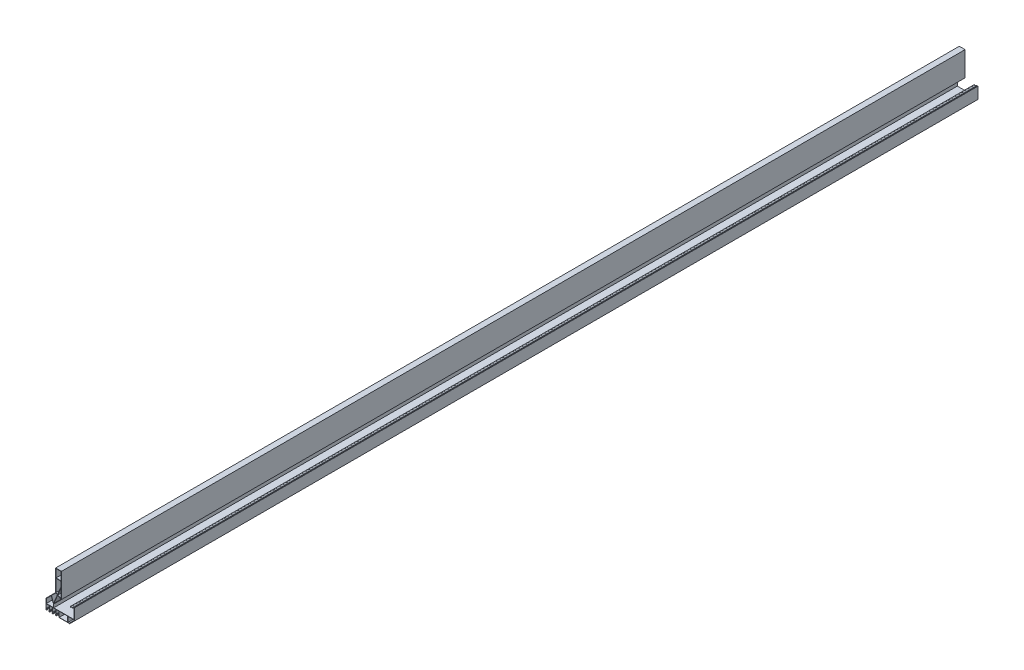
from build123d import *

# Parameters (mm, degrees)
ESQUISSE1_W        = 40
ESQUISSE1_H        = 63.294922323
ESQUISSE1_W_2      = 64.883207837
ESQUISSE1_H_2      = 41
BOSS_EXTRU_1_DEPTH = 7000


with BuildPart() as part:
    # Esquisse1 → Boss.-Extru.1 (new body)
    with BuildSketch(Plane.XY):
        with BuildLine():
            Line((45, 165), (45, -24.497474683))
            Line((45, -24.497474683), (-15, -84.497474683))
            Line((-15, -84.497474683), (-15, -110))
            Line((-15, -110), (143, -110))
            Line((143, -110), (143, -37))
            Line((143, -37), (129.1, -37))
            Line((129.1, -37), (129.1, -38.5))
            ThreePointArc((129.1, -38.5), (128.807106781, -39.207106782), (128.1, -39.5))
            Line((128.1, -39.5), (127.6, -39.5))
            Line((127.6, -39.5), (127.6, -37))
            Line((127.6, -37), (116.3, -37))
            Line((116.3, -37), (116.3, -41.5))
            Line((116.3, -41.5), (116, -41.5))
            ThreePointArc((116, -41.5), (115.292893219, -41.207106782), (115, -40.5))
            Line((115, -40.5), (115, -35))
            Line((115, -35), (121.5, -35))
            Line((121.5, -35), (121.8, -35.3))
            Line((121.8, -35.3), (122.1, -35.3))
            Line((122.1, -35.3), (122.4, -35))
            Line((122.4, -35), (135.599999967, -35))
            Line((135.599999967, -35), (135.599999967, -30.000000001))
            Line((135.599999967, -30.000000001), (137.326794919, -30.000000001))
            Line((137.326794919, -30.000000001), (137.759807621, -30.750000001))
            ThreePointArc((137.759807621, -30.750000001), (137.759807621, -31.050000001), (137.5, -31.200000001))
            Line((137.5, -31.200000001), (136.999999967, -31.200000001))
            Line((136.999999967, -31.200000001), (136.999999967, -35))
            Line((136.999999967, -35), (143.7, -35))
            Line((143.7, -35), (143.7, -31.2))
            Line((143.7, -31.2), (143.5, -31.2))
            ThreePointArc((143.5, -31.2), (143.240192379, -31.05), (143.240192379, -30.75))
            Line((143.240192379, -30.75), (143.673205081, -30))
            Line((143.673205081, -30), (145.000000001, -30))
            Line((145.000000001, -30), (145.000000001, -119.018741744))
            Line((145.000000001, -119.018741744), (142.979084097, -121.039657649))
            ThreePointArc((142.979084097, -121.039657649), (142.83766274, -121.098236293), (142.696241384, -121.039657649))
            Line((142.696241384, -121.039657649), (142.130555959, -120.473972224))
            ThreePointArc((142.130555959, -120.473972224), (141.989134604, -120.415393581), (141.847713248, -120.473972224))
            Line((141.847713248, -120.473972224), (141.653612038, -120.668073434))
            ThreePointArc((141.653612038, -120.668073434), (140.5278998, -121.232942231), (139.287774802, -121.012954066))
            Line((139.287774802, -121.012954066), (138.284586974, -120.470255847))
            ThreePointArc((138.284586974, -120.470255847), (138.137251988, -120.282906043), (138.173013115, -120.047260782))
            Line((138.173013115, -120.047260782), (138.59378811, -119.374793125))
            ThreePointArc((138.59378811, -119.374793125), (138.771591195, -119.243845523), (138.990849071, -119.270059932))
            Line((138.990849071, -119.270059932), (139.593700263, -119.596186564))
            ThreePointArc((139.593700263, -119.596186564), (140.213762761, -119.706180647), (140.776618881, -119.423746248))
            ThreePointArc((140.776618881, -119.423746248), (141.33433869, -119.052678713), (141.992111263, -118.925880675))
            ThreePointArc((141.992111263, -118.925880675), (142.70431217, -118.635802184), (143.000000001, -117.925911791))
            Line((143.000000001, -117.925911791), (143.000000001, -112))
            Line((143.000000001, -112), (94.483207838, -112))
            Line((94.483207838, -112), (94.483207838, -153.5))
            Line((94.483207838, -153.5), (107.983207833, -153.5))
            ThreePointArc((107.983207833, -153.5), (108.365891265, -153.423879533), (108.690314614, -153.207106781))
            Line((108.690314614, -153.207106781), (108.836706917, -153.060714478))
            ThreePointArc((108.836706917, -153.060714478), (108.891737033, -152.956800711), (108.878861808, -152.839922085))
            ThreePointArc((108.878861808, -152.839922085), (108.769422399, -151.846453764), (109.237178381, -150.963186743))
            ThreePointArc((109.237178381, -150.963186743), (109.519612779, -150.400330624), (109.409618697, -149.780268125))
            Line((109.409618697, -149.780268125), (109.083492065, -149.177416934))
            ThreePointArc((109.083492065, -149.177416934), (109.057277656, -148.958159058), (109.188225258, -148.780355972))
            Line((109.188225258, -148.780355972), (109.860692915, -148.359580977))
            ThreePointArc((109.860692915, -148.359580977), (110.096338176, -148.323819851), (110.28368798, -148.471154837))
            Line((110.28368798, -148.471154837), (110.826386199, -149.474342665))
            ThreePointArc((110.826386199, -149.474342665), (111.046374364, -150.714467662), (110.481505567, -151.840179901))
            Line((110.481505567, -151.840179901), (110.287404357, -152.034281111))
            ThreePointArc((110.287404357, -152.034281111), (110.228825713, -152.175702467), (110.287404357, -152.317123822))
            Line((110.287404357, -152.317123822), (110.853089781, -152.882809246))
            ThreePointArc((110.853089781, -152.882809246), (110.911668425, -153.024230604), (110.853089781, -153.165651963))
            Line((110.853089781, -153.165651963), (109.018741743, -155))
            Line((109.018741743, -155), (24.449999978, -155))
            ThreePointArc((24.449999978, -155), (24.308578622, -154.941421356), (24.249999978, -154.8))
            Line((24.249999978, -154.8), (24.249999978, -153.8))
            Line((24.249999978, -153.8), (23.599999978, -153.8))
            ThreePointArc((23.599999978, -153.8), (23.458578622, -153.741421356), (23.399999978, -153.6))
            Line((23.399999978, -153.6), (23.399999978, -151.3))
            ThreePointArc((23.399999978, -151.3), (23.458578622, -151.158578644), (23.599999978, -151.1))
            Line((23.599999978, -151.1), (23.9, -151.1))
            ThreePointArc((23.9, -151.1), (24.253553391, -151.246446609), (24.4, -151.6))
            Line((24.4, -151.6), (24.4, -152.280131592))
            ThreePointArc((24.4, -152.280131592), (24.456972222, -152.456022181), (24.606249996, -152.565106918))
            ThreePointArc((24.606249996, -152.565106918), (24.91562813, -152.714699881), (25.174999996, -152.940130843))
            ThreePointArc((25.174999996, -152.940130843), (25.506066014, -153.022323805), (25.7, -152.7416995))
            Line((25.7, -152.7416995), (25.7, -145.05))
            Line((25.7, -145.05), (24.4, -145.05))
            Line((24.4, -145.05), (24.4, -146.2))
            ThreePointArc((24.4, -146.2), (23.9, -146.7), (23.4, -146.2))
            Line((23.4, -146.2), (23.4, -144.3))
            ThreePointArc((23.4, -144.3), (23.546446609, -143.946446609), (23.9, -143.8))
            Line((23.9, -143.8), (25.9, -143.8))
            ThreePointArc((25.9, -143.8), (26.112132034, -143.712132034), (26.2, -143.5))
            Line((26.2, -143.5), (26.2, -112))
            Line((26.2, -112), (2.3, -112))
            Line((2.3, -112), (2.3, -143.5))
            ThreePointArc((2.3, -143.5), (2.387867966, -143.712132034), (2.6, -143.8))
            Line((2.6, -143.8), (4.6, -143.8))
            ThreePointArc((4.6, -143.8), (4.953553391, -143.946446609), (5.1, -144.3))
            Line((5.1, -144.3), (5.1, -146.2))
            ThreePointArc((5.1, -146.2), (4.6, -146.7), (4.1, -146.2))
            Line((4.1, -146.2), (4.1, -145.05))
            Line((4.1, -145.05), (2.8, -145.05))
            Line((2.8, -145.05), (2.8, -152.7416995))
            ThreePointArc((2.8, -152.7416995), (2.993933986, -153.022323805), (3.325000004, -152.940130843))
            ThreePointArc((3.325000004, -152.940130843), (3.58437187, -152.714699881), (3.893750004, -152.565106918))
            ThreePointArc((3.893750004, -152.565106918), (4.043027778, -152.456022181), (4.1, -152.280131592))
            Line((4.1, -152.280131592), (4.1, -151.6))
            ThreePointArc((4.1, -151.6), (4.246446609, -151.246446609), (4.6, -151.1))
            Line((4.6, -151.1), (4.900000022, -151.1))
            ThreePointArc((4.900000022, -151.1), (5.041421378, -151.158578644), (5.100000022, -151.3))
            Line((5.100000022, -151.3), (5.100000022, -153.6))
            ThreePointArc((5.100000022, -153.6), (5.041421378, -153.741421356), (4.900000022, -153.8))
            Line((4.900000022, -153.8), (4.250000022, -153.8))
            Line((4.250000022, -153.8), (4.250000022, -154.8))
            ThreePointArc((4.250000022, -154.8), (4.191421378, -154.941421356), (4.050000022, -155))
            Line((4.050000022, -155), (-0.850000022, -155))
            ThreePointArc((-0.850000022, -155), (-0.991421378, -154.941421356), (-1.050000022, -154.8))
            Line((-1.050000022, -154.8), (-1.050000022, -153.8))
            Line((-1.050000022, -153.8), (-1.700000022, -153.8))
            ThreePointArc((-1.700000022, -153.8), (-1.841421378, -153.741421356), (-1.900000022, -153.6))
            Line((-1.900000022, -153.6), (-1.900000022, -151.3))
            ThreePointArc((-1.900000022, -151.3), (-1.841421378, -151.158578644), (-1.700000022, -151.1))
            Line((-1.700000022, -151.1), (-1.4, -151.1))
            ThreePointArc((-1.4, -151.1), (-1.046446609, -151.246446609), (-0.9, -151.6))
            Line((-0.9, -151.6), (-0.9, -152.280131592))
            ThreePointArc((-0.9, -152.280131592), (-0.843027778, -152.456022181), (-0.693750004, -152.565106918))
            ThreePointArc((-0.693750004, -152.565106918), (-0.38437187, -152.714699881), (-0.125000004, -152.940130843))
            ThreePointArc((-0.125000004, -152.940130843), (0.206066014, -153.022323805), (0.4, -152.7416995))
            Line((0.4, -152.7416995), (0.4, -145.05))
            Line((0.4, -145.05), (-0.9, -145.05))
            Line((-0.9, -145.05), (-0.9, -146.2))
            ThreePointArc((-0.9, -146.2), (-1.4, -146.7), (-1.9, -146.2))
            Line((-1.9, -146.2), (-1.9, -144.3))
            ThreePointArc((-1.9, -144.3), (-1.753553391, -143.946446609), (-1.4, -143.8))
            Line((-1.4, -143.8), (0.6, -143.8))
            ThreePointArc((0.6, -143.8), (0.812132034, -143.712132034), (0.9, -143.5))
            Line((0.9, -143.5), (0.9, -112))
            Line((0.9, -112), (-23, -112))
            Line((-23, -112), (-23, -143.5))
            ThreePointArc((-23, -143.5), (-22.912132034, -143.712132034), (-22.7, -143.8))
            Line((-22.7, -143.8), (-20.7, -143.8))
            ThreePointArc((-20.7, -143.8), (-20.346446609, -143.946446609), (-20.2, -144.3))
            Line((-20.2, -144.3), (-20.2, -146.2))
            ThreePointArc((-20.2, -146.2), (-20.7, -146.7), (-21.2, -146.2))
            Line((-21.2, -146.2), (-21.2, -145.05))
            Line((-21.2, -145.05), (-22.5, -145.05))
            Line((-22.5, -145.05), (-22.5, -152.7416995))
            ThreePointArc((-22.5, -152.7416995), (-22.306066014, -153.022323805), (-21.974999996, -152.940130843))
            ThreePointArc((-21.974999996, -152.940130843), (-21.71562813, -152.714699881), (-21.406249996, -152.565106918))
            ThreePointArc((-21.406249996, -152.565106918), (-21.256972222, -152.456022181), (-21.2, -152.280131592))
            Line((-21.2, -152.280131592), (-21.2, -151.6))
            ThreePointArc((-21.2, -151.6), (-21.053553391, -151.246446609), (-20.7, -151.1))
            Line((-20.7, -151.1), (-20.399999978, -151.1))
            ThreePointArc((-20.399999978, -151.1), (-20.258578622, -151.158578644), (-20.199999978, -151.3))
            Line((-20.199999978, -151.3), (-20.199999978, -153.6))
            ThreePointArc((-20.199999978, -153.6), (-20.258578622, -153.741421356), (-20.399999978, -153.8))
            Line((-20.399999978, -153.8), (-21.049999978, -153.8))
            Line((-21.049999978, -153.8), (-21.049999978, -154.8))
            ThreePointArc((-21.049999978, -154.8), (-21.108578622, -154.941421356), (-21.249999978, -155))
            Line((-21.249999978, -155), (-26.150000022, -155))
            ThreePointArc((-26.150000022, -155), (-26.291421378, -154.941421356), (-26.350000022, -154.8))
            Line((-26.350000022, -154.8), (-26.350000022, -153.8))
            Line((-26.350000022, -153.8), (-27.000000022, -153.8))
            ThreePointArc((-27.000000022, -153.8), (-27.141421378, -153.741421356), (-27.200000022, -153.6))
            Line((-27.200000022, -153.6), (-27.200000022, -151.3))
            ThreePointArc((-27.200000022, -151.3), (-27.141421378, -151.158578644), (-27.000000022, -151.1))
            Line((-27.000000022, -151.1), (-26.7, -151.1))
            ThreePointArc((-26.7, -151.1), (-26.346446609, -151.246446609), (-26.2, -151.6))
            Line((-26.2, -151.6), (-26.2, -152.280131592))
            ThreePointArc((-26.2, -152.280131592), (-26.143027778, -152.456022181), (-25.993750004, -152.565106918))
            ThreePointArc((-25.993750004, -152.565106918), (-25.68437187, -152.714699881), (-25.425000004, -152.940130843))
            ThreePointArc((-25.425000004, -152.940130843), (-25.093933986, -153.022323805), (-24.9, -152.7416995))
            Line((-24.9, -152.7416995), (-24.9, -145.05))
            Line((-24.9, -145.05), (-26.2, -145.05))
            Line((-26.2, -145.05), (-26.2, -146.2))
            ThreePointArc((-26.2, -146.2), (-26.7, -146.7), (-27.2, -146.2))
            Line((-27.2, -146.2), (-27.2, -144.3))
            ThreePointArc((-27.2, -144.3), (-27.053553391, -143.946446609), (-26.7, -143.8))
            Line((-26.7, -143.8), (-24.7, -143.8))
            ThreePointArc((-24.7, -143.8), (-24.487867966, -143.712132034), (-24.4, -143.5))
            Line((-24.4, -143.5), (-24.4, -112))
            Line((-24.4, -112), (-48.3, -112))
            Line((-48.3, -112), (-48.3, -143.5))
            ThreePointArc((-48.3, -143.5), (-48.212132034, -143.712132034), (-48, -143.8))
            Line((-48, -143.8), (-46, -143.8))
            ThreePointArc((-46, -143.8), (-45.646446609, -143.946446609), (-45.5, -144.3))
            Line((-45.5, -144.3), (-45.5, -146.2))
            ThreePointArc((-45.5, -146.2), (-46, -146.7), (-46.5, -146.2))
            Line((-46.5, -146.2), (-46.5, -145.05))
            Line((-46.5, -145.05), (-47.8, -145.05))
            Line((-47.8, -145.05), (-47.8, -152.7416995))
            ThreePointArc((-47.8, -152.7416995), (-47.606066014, -153.022323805), (-47.274999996, -152.940130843))
            ThreePointArc((-47.274999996, -152.940130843), (-47.01562813, -152.714699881), (-46.706249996, -152.565106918))
            ThreePointArc((-46.706249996, -152.565106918), (-46.556972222, -152.456022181), (-46.5, -152.280131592))
            Line((-46.5, -152.280131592), (-46.5, -151.6))
            ThreePointArc((-46.5, -151.6), (-46.353553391, -151.246446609), (-46, -151.1))
            Line((-46, -151.1), (-45.699999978, -151.1))
            ThreePointArc((-45.699999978, -151.1), (-45.558578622, -151.158578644), (-45.499999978, -151.3))
            Line((-45.499999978, -151.3), (-45.499999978, -153.6))
            ThreePointArc((-45.499999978, -153.6), (-45.558578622, -153.741421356), (-45.699999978, -153.8))
            Line((-45.699999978, -153.8), (-46.349999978, -153.8))
            Line((-46.349999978, -153.8), (-46.349999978, -154.8))
            ThreePointArc((-46.349999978, -154.8), (-46.408578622, -154.941421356), (-46.549999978, -155))
            Line((-46.549999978, -155), (-51.450000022, -155))
            ThreePointArc((-51.450000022, -155), (-51.591421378, -154.941421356), (-51.650000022, -154.8))
            Line((-51.650000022, -154.8), (-51.650000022, -153.8))
            Line((-51.650000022, -153.8), (-52.300000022, -153.8))
            ThreePointArc((-52.300000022, -153.8), (-52.441421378, -153.741421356), (-52.500000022, -153.6))
            Line((-52.500000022, -153.6), (-52.500000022, -151.3))
            ThreePointArc((-52.500000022, -151.3), (-52.441421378, -151.158578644), (-52.300000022, -151.1))
            Line((-52.300000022, -151.1), (-52, -151.1))
            ThreePointArc((-52, -151.1), (-51.646446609, -151.246446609), (-51.5, -151.6))
            Line((-51.5, -151.6), (-51.5, -152.280131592))
            ThreePointArc((-51.5, -152.280131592), (-51.443027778, -152.456022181), (-51.293750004, -152.565106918))
            ThreePointArc((-51.293750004, -152.565106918), (-50.98437187, -152.714699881), (-50.725000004, -152.940130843))
            ThreePointArc((-50.725000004, -152.940130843), (-50.393933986, -153.022323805), (-50.2, -152.7416995))
            Line((-50.2, -152.7416995), (-50.2, -145.05))
            Line((-50.2, -145.05), (-51.5, -145.05))
            Line((-51.5, -145.05), (-51.5, -146.2))
            ThreePointArc((-51.5, -146.2), (-52, -146.7), (-52.5, -146.2))
            Line((-52.5, -146.2), (-52.5, -144.3))
            ThreePointArc((-52.5, -144.3), (-52.353553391, -143.946446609), (-52, -143.8))
            Line((-52, -143.8), (-50, -143.8))
            ThreePointArc((-50, -143.8), (-49.787867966, -143.712132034), (-49.7, -143.5))
            Line((-49.7, -143.5), (-49.7, -112))
            Line((-49.7, -112), (-73.6, -112))
            Line((-73.6, -112), (-73.6, -143.5))
            ThreePointArc((-73.6, -143.5), (-73.512132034, -143.712132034), (-73.3, -143.8))
            Line((-73.3, -143.8), (-71.3, -143.8))
            ThreePointArc((-71.3, -143.8), (-70.946446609, -143.946446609), (-70.8, -144.3))
            Line((-70.8, -144.3), (-70.8, -146.2))
            ThreePointArc((-70.8, -146.2), (-71.3, -146.7), (-71.8, -146.2))
            Line((-71.8, -146.2), (-71.8, -145.05))
            Line((-71.8, -145.05), (-73.1, -145.05))
            Line((-73.1, -145.05), (-73.1, -152.7416995))
            ThreePointArc((-73.1, -152.7416995), (-72.906066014, -153.022323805), (-72.574999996, -152.940130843))
            ThreePointArc((-72.574999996, -152.940130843), (-72.31562813, -152.714699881), (-72.006249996, -152.565106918))
            ThreePointArc((-72.006249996, -152.565106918), (-71.856972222, -152.456022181), (-71.8, -152.280131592))
            Line((-71.8, -152.280131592), (-71.8, -151.6))
            ThreePointArc((-71.8, -151.6), (-71.653553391, -151.246446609), (-71.3, -151.1))
            Line((-71.3, -151.1), (-70.999999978, -151.1))
            ThreePointArc((-70.999999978, -151.1), (-70.858578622, -151.158578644), (-70.799999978, -151.3))
            Line((-70.799999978, -151.3), (-70.799999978, -153.6))
            ThreePointArc((-70.799999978, -153.6), (-70.858578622, -153.741421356), (-70.999999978, -153.8))
            Line((-70.999999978, -153.8), (-71.649999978, -153.8))
            Line((-71.649999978, -153.8), (-71.649999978, -154.8))
            ThreePointArc((-71.649999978, -154.8), (-71.708578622, -154.941421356), (-71.849999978, -155))
            Line((-71.849999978, -155), (-75, -155))
            Line((-75, -155), (-75, -75))
            Line((-75, -75), (0, 0))
            Line((0, 0), (0, 165))
            Line((0, 165), (45, 165))
        make_face()
        with Locations((22.5, 130.852538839)):
            Rectangle(ESQUISSE1_W, ESQUISSE1_H, mode=Mode.SUBTRACT)
        Polygon((42.5, 96.705077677), (42.5, 61.422786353), (14.367372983, -6.256039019), (2.5, 0.397524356), (2.5, 96.705077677), align=None, mode=Mode.SUBTRACT)
        Polygon((42.5, 54.909616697), (42.5, -22.028882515), (16.56304594, -7.487065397), align=None, mode=Mode.SUBTRACT)
        Polygon((1.581761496, -1.95377241), (-33.069148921, -36.604682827), (-16.22401143, -79.849911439), (13.401168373, -8.5804431), align=None, mode=Mode.SUBTRACT)
        Polygon((-35, -38.535533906), (-72.5, -76.035533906), (-72.5, -109.5), (-17.5, -109.5), (-17.5, -83.461940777), align=None, mode=Mode.SUBTRACT)
        Polygon((41.581761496, -24.380179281), (-13.252458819, -79.214399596), (15.596841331, -9.811469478), align=None, mode=Mode.SUBTRACT)
        with Locations((60.041603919, -132.5)):
            Rectangle(ESQUISSE1_W_2, ESQUISSE1_H_2, mode=Mode.SUBTRACT)
    extrude(amount=BOSS_EXTRU_1_DEPTH)


solid = part.part
